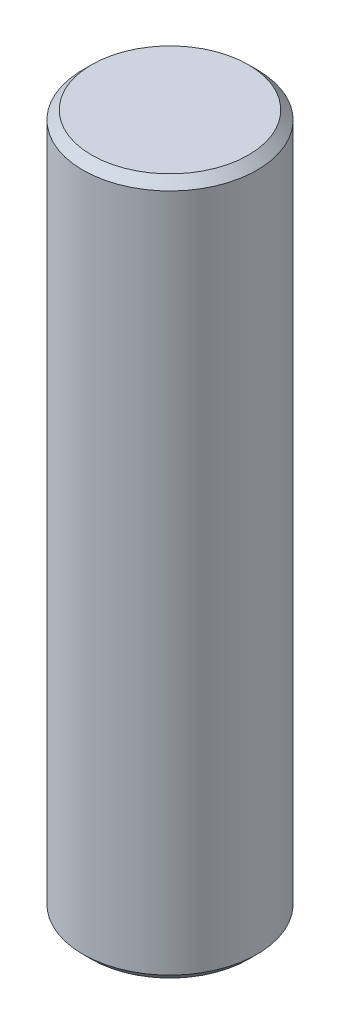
from build123d import *

# Parameters (mm, degrees)
SKETCH1_R           = 1
BOSS_EXTRUDE1_DEPTH = 8
CHAMFER1_SIZE       = 0.1


with BuildPart() as part:
    # Sketch1 → Boss-Extrude1 (new body)
    with BuildSketch(Plane(origin=(0, 0, 0), x_dir=(1, 0, 0), z_dir=(0, 1, 0))):
        with Locations(Location((0, 0, 0), (0, 0, 270))):
            Circle(SKETCH1_R)
    extrude(amount=BOSS_EXTRUDE1_DEPTH)

    # Chamfer1
    chamfer1_edges = [part.edges().sort_by_distance(p)[0] for p in [
        (0, 0, -1),
        (0, 8, -1),
    ]]
    chamfer(chamfer1_edges, length=CHAMFER1_SIZE)


solid = part.part
